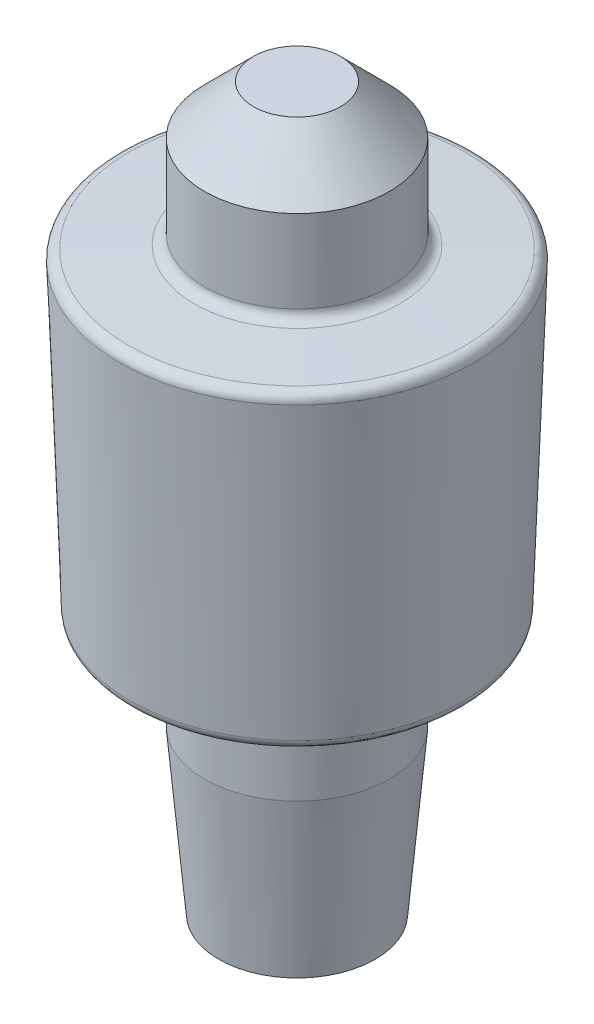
ISO-10303-21;
HEADER;
FILE_DESCRIPTION(('STEP AP214'),'2;1');
FILE_NAME('part.step','',(''),(''),'','','');
FILE_SCHEMA(('AUTOMOTIVE_DESIGN { 1 0 10303 214 1 1 1 1 }'));
ENDSEC;
DATA;
#1=APPLICATION_CONTEXT('core data for automotive mechanical design processes');
#2=APPLICATION_PROTOCOL_DEFINITION('international standard','automotive_design',2000,#1);
#3=PRODUCT_CONTEXT('',#1,'mechanical');
#4=PRODUCT('Part','Part','',(#3));
#5=PRODUCT_RELATED_PRODUCT_CATEGORY('part','',(#4));
#6=PRODUCT_DEFINITION_FORMATION('','',#4);
#7=PRODUCT_DEFINITION_CONTEXT('part definition',#1,'design');
#8=PRODUCT_DEFINITION('design','',#6,#7);
#9=PRODUCT_DEFINITION_SHAPE('','',#8);
#10=(LENGTH_UNIT() NAMED_UNIT(*) SI_UNIT(.MILLI.,.METRE.));
#11=(NAMED_UNIT(*) PLANE_ANGLE_UNIT() SI_UNIT($,.RADIAN.));
#12=(NAMED_UNIT(*) SI_UNIT($,.STERADIAN.) SOLID_ANGLE_UNIT());
#13=UNCERTAINTY_MEASURE_WITH_UNIT(LENGTH_MEASURE(1.E-05),#10,'distance_accuracy_value','');
#14=(GEOMETRIC_REPRESENTATION_CONTEXT(3) GLOBAL_UNCERTAINTY_ASSIGNED_CONTEXT((#13)) GLOBAL_UNIT_ASSIGNED_CONTEXT((#10,
#11,#12)) REPRESENTATION_CONTEXT('',''));
#15=CARTESIAN_POINT('',(0.,0.,0.));
#16=DIRECTION('',(0.,0.,1.));
#17=DIRECTION('',(1.,0.,0.));
#18=AXIS2_PLACEMENT_3D('',#15,#16,#17);
#19=CARTESIAN_POINT('',(-13.7594101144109,-64.5958129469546,-9.03571118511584E-12));
#20=DIRECTION('',(0.,1.,0.));
#21=DIRECTION('',(-0.964273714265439,0.,-0.264907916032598));
#22=AXIS2_PLACEMENT_3D('',#19,#20,#21);
#23=CONICAL_SURFACE('',#22,50.6843004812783,0.0349065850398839);
#24=CARTESIAN_POINT('',(-13.7594101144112,-53.6219287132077,-9.14055835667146E-12));
#25=DIRECTION('',(0.,1.,0.));
#26=DIRECTION('',(-1.,0.,0.));
#27=AXIS2_PLACEMENT_3D('',#24,#25,#26);
#28=CIRCLE('',#27,51.067516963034);
#29=CARTESIAN_POINT('',(-64.8269270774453,-53.6219287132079,-9.14055835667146E-12));
#30=VERTEX_POINT('',#29);
#31=EDGE_CURVE('E10',#30,#30,#28,.T.);
#32=ORIENTED_EDGE('',*,*,#31,.T.);
#33=EDGE_LOOP('',(#32));
#34=FACE_BOUND('',#33,.T.);
#35=CARTESIAN_POINT('',(-13.7594101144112,37.6434261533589,-9.22483774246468E-12));
#36=DIRECTION('',(0.,-1.,0.));
#37=DIRECTION('',(1.,0.,0.));
#38=AXIS2_PLACEMENT_3D('',#35,#36,#37);
#39=CIRCLE('',#38,54.2545733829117);
#40=CARTESIAN_POINT('',(40.4951632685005,37.6434261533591,-9.22483774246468E-12));
#41=VERTEX_POINT('',#40);
#42=EDGE_CURVE('E46',#41,#41,#39,.T.);
#43=ORIENTED_EDGE('',*,*,#42,.T.);
#44=EDGE_LOOP('',(#43));
#45=FACE_BOUND('',#44,.T.);
#46=ADVANCED_FACE('F31',(#34,#45),#23,.T.);
#47=CARTESIAN_POINT('',(-13.7594101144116,40.337284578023,-9.37593259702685E-12));
#48=DIRECTION('',(0.,-1.,0.));
#49=DIRECTION('',(1.,0.,0.));
#50=AXIS2_PLACEMENT_3D('',#47,#48,#49);
#51=CONICAL_SURFACE('',#50,59.1742541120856,1.51843644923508);
#52=CARTESIAN_POINT('',(-13.7594101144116,40.7440132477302,-9.37593259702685E-12));
#53=DIRECTION('',(0.,1.,0.));
#54=DIRECTION('',(-1.,0.,0.));
#55=AXIS2_PLACEMENT_3D('',#52,#53,#54);
#56=CIRCLE('',#55,51.4134087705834);
#57=CARTESIAN_POINT('',(-65.172818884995,40.7440132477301,-9.37593259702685E-12));
#58=VERTEX_POINT('',#57);
#59=EDGE_CURVE('E42',#58,#58,#56,.T.);
#60=ORIENTED_EDGE('',*,*,#59,.T.);
#61=EDGE_LOOP('',(#60));
#62=FACE_BOUND('',#61,.T.);
#63=CARTESIAN_POINT('',(-13.7594101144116,41.7941021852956,-9.37593259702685E-12));
#64=DIRECTION('',(0.,-1.,0.));
#65=DIRECTION('',(1.,0.,0.));
#66=AXIS2_PLACEMENT_3D('',#63,#64,#65);
#67=CIRCLE('',#66,31.3765182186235);
#68=CARTESIAN_POINT('',(17.6171081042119,41.7941021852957,-9.37593259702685E-12));
#69=VERTEX_POINT('',#68);
#70=EDGE_CURVE('E71',#69,#69,#67,.T.);
#71=ORIENTED_EDGE('',*,*,#70,.T.);
#72=EDGE_LOOP('',(#71));
#73=FACE_BOUND('',#72,.T.);
#74=ADVANCED_FACE('F105',(#62,#73),#51,.T.);
#75=CARTESIAN_POINT('',(-13.7594101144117,85.1341831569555,-9.37593259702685E-12));
#76=DIRECTION('',(0.,1.,0.));
#77=DIRECTION('',(-1.,0.,0.));
#78=AXIS2_PLACEMENT_3D('',#75,#76,#77);
#79=PLANE('',#78);
#80=CARTESIAN_POINT('',(-13.7594101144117,85.1341831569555,-9.37593259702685E-12));
#81=DIRECTION('',(0.,1.,0.));
#82=DIRECTION('',(-1.,0.,0.));
#83=AXIS2_PLACEMENT_3D('',#80,#81,#82);
#84=CIRCLE('',#83,13.3400809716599);
#85=CARTESIAN_POINT('',(-27.0994910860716,85.1341831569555,-9.37593259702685E-12));
#86=VERTEX_POINT('',#85);
#87=EDGE_CURVE('E56',#86,#86,#84,.T.);
#88=ORIENTED_EDGE('',*,*,#87,.T.);
#89=EDGE_LOOP('',(#88));
#90=FACE_BOUND('',#89,.T.);
#91=ADVANCED_FACE('F110',(#90),#79,.T.);
#92=CARTESIAN_POINT('',(-13.7594101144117,70.1341831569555,-9.37593259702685E-12));
#93=DIRECTION('',(0.,-1.,0.));
#94=DIRECTION('',(-1.,0.,0.));
#95=AXIS2_PLACEMENT_3D('',#92,#93,#94);
#96=CONICAL_SURFACE('',#95,28.3400809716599,0.785398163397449);
#97=ORIENTED_EDGE('',*,*,#87,.F.);
#98=EDGE_LOOP('',(#97));
#99=FACE_BOUND('',#98,.T.);
#100=CARTESIAN_POINT('',(-13.7594101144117,70.1341831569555,-9.37593259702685E-12));
#101=DIRECTION('',(0.,1.,0.));
#102=DIRECTION('',(-0.964273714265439,0.,-0.264907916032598));
#103=AXIS2_PLACEMENT_3D('',#100,#101,#102);
#104=CIRCLE('',#103,28.3400809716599);
#105=CARTESIAN_POINT('',(-41.0870052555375,70.1341831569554,-7.5075117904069));
#106=VERTEX_POINT('',#105);
#107=EDGE_CURVE('E55',#106,#106,#104,.T.);
#108=ORIENTED_EDGE('',*,*,#107,.T.);
#109=EDGE_LOOP('',(#108));
#110=FACE_BOUND('',#109,.T.);
#111=ADVANCED_FACE('F136',(#99,#110),#96,.T.);
#112=CARTESIAN_POINT('',(-13.7594101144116,41.7941021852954,-9.32350789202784E-12));
#113=DIRECTION('',(0.,1.,0.));
#114=DIRECTION('',(-0.964273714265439,0.,-0.264907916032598));
#115=AXIS2_PLACEMENT_3D('',#112,#113,#114);
#116=CYLINDRICAL_SURFACE('',#115,28.3400809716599);
#117=CARTESIAN_POINT('',(-13.7594101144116,44.8305394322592,-9.32912482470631E-12));
#118=DIRECTION('',(0.,1.,0.));
#119=DIRECTION('',(-0.964273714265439,0.,-0.264907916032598));
#120=AXIS2_PLACEMENT_3D('',#117,#118,#119);
#121=CIRCLE('',#120,28.3400809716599);
#122=CARTESIAN_POINT('',(-41.0870052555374,44.8305394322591,-7.50751179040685));
#123=VERTEX_POINT('',#122);
#124=EDGE_CURVE('E51',#123,#123,#121,.F.);
#125=CARTESIAN_POINT('',(-41.0870052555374,44.8305394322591,-7.50751179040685));
#126=CARTESIAN_POINT('',(-41.0870052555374,45.0941190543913,-7.50751179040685));
#127=CARTESIAN_POINT('',(-41.0870052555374,45.3576986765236,-7.50751179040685));
#128=CARTESIAN_POINT('',(-41.0870052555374,45.8848579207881,-7.50751179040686));
#129=CARTESIAN_POINT('',(-41.0870052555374,46.1484375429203,-7.50751179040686));
#130=CARTESIAN_POINT('',(-41.0870052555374,46.6755967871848,-7.50751179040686));
#131=CARTESIAN_POINT('',(-41.0870052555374,46.9391764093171,-7.50751179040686));
#132=CARTESIAN_POINT('',(-41.0870052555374,47.4663356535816,-7.50751179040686));
#133=CARTESIAN_POINT('',(-41.0870052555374,47.7299152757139,-7.50751179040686));
#134=CARTESIAN_POINT('',(-41.0870052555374,48.2570745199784,-7.50751179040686));
#135=CARTESIAN_POINT('',(-41.0870052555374,48.5206541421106,-7.50751179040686));
#136=CARTESIAN_POINT('',(-41.0870052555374,49.0478133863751,-7.50751179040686));
#137=CARTESIAN_POINT('',(-41.0870052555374,49.3113930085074,-7.50751179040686));
#138=CARTESIAN_POINT('',(-41.0870052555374,49.8385522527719,-7.50751179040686));
#139=CARTESIAN_POINT('',(-41.0870052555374,50.1021318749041,-7.50751179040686));
#140=CARTESIAN_POINT('',(-41.0870052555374,50.6292911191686,-7.50751179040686));
#141=CARTESIAN_POINT('',(-41.0870052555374,50.8928707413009,-7.50751179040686));
#142=CARTESIAN_POINT('',(-41.0870052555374,51.4200299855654,-7.50751179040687));
#143=CARTESIAN_POINT('',(-41.0870052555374,51.6836096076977,-7.50751179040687));
#144=CARTESIAN_POINT('',(-41.0870052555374,52.2107688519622,-7.50751179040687));
#145=CARTESIAN_POINT('',(-41.0870052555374,52.4743484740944,-7.50751179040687));
#146=CARTESIAN_POINT('',(-41.0870052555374,53.0015077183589,-7.50751179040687));
#147=CARTESIAN_POINT('',(-41.0870052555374,53.2650873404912,-7.50751179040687));
#148=CARTESIAN_POINT('',(-41.0870052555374,53.7922465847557,-7.50751179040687));
#149=CARTESIAN_POINT('',(-41.0870052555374,54.0558262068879,-7.50751179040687));
#150=CARTESIAN_POINT('',(-41.0870052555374,54.5829854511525,-7.50751179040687));
#151=CARTESIAN_POINT('',(-41.0870052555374,54.8465650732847,-7.50751179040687));
#152=CARTESIAN_POINT('',(-41.0870052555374,55.3737243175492,-7.50751179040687));
#153=CARTESIAN_POINT('',(-41.0870052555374,55.6373039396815,-7.50751179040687));
#154=CARTESIAN_POINT('',(-41.0870052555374,56.164463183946,-7.50751179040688));
#155=CARTESIAN_POINT('',(-41.0870052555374,56.4280428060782,-7.50751179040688));
#156=CARTESIAN_POINT('',(-41.0870052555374,56.9552020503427,-7.50751179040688));
#157=CARTESIAN_POINT('',(-41.0870052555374,57.218781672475,-7.50751179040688));
#158=CARTESIAN_POINT('',(-41.0870052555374,57.7459409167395,-7.50751179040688));
#159=CARTESIAN_POINT('',(-41.0870052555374,58.0095205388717,-7.50751179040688));
#160=CARTESIAN_POINT('',(-41.0870052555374,58.5366797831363,-7.50751179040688));
#161=CARTESIAN_POINT('',(-41.0870052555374,58.8002594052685,-7.50751179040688));
#162=CARTESIAN_POINT('',(-41.0870052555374,59.327418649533,-7.50751179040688));
#163=CARTESIAN_POINT('',(-41.0870052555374,59.5909982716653,-7.50751179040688));
#164=CARTESIAN_POINT('',(-41.0870052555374,60.1181575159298,-7.50751179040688));
#165=CARTESIAN_POINT('',(-41.0870052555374,60.381737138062,-7.50751179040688));
#166=CARTESIAN_POINT('',(-41.0870052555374,60.9088963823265,-7.50751179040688));
#167=CARTESIAN_POINT('',(-41.0870052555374,61.1724760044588,-7.50751179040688));
#168=CARTESIAN_POINT('',(-41.0870052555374,61.6996352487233,-7.50751179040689));
#169=CARTESIAN_POINT('',(-41.0870052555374,61.9632148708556,-7.50751179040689));
#170=CARTESIAN_POINT('',(-41.0870052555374,62.4903741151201,-7.50751179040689));
#171=CARTESIAN_POINT('',(-41.0870052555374,62.7539537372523,-7.50751179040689));
#172=CARTESIAN_POINT('',(-41.0870052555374,63.2811129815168,-7.50751179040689));
#173=CARTESIAN_POINT('',(-41.0870052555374,63.5446926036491,-7.50751179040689));
#174=CARTESIAN_POINT('',(-41.0870052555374,64.0718518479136,-7.50751179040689));
#175=CARTESIAN_POINT('',(-41.0870052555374,64.3354314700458,-7.50751179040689));
#176=CARTESIAN_POINT('',(-41.0870052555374,64.8625907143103,-7.50751179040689));
#177=CARTESIAN_POINT('',(-41.0870052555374,65.1261703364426,-7.50751179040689));
#178=CARTESIAN_POINT('',(-41.0870052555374,65.6533295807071,-7.50751179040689));
#179=CARTESIAN_POINT('',(-41.0870052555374,65.9169092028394,-7.50751179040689));
#180=CARTESIAN_POINT('',(-41.0870052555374,66.4440684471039,-7.50751179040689));
#181=CARTESIAN_POINT('',(-41.0870052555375,66.7076480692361,-7.50751179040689));
#182=CARTESIAN_POINT('',(-41.0870052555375,67.2348073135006,-7.50751179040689));
#183=CARTESIAN_POINT('',(-41.0870052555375,67.4983869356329,-7.5075117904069));
#184=CARTESIAN_POINT('',(-41.0870052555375,68.0255461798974,-7.5075117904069));
#185=CARTESIAN_POINT('',(-41.0870052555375,68.2891258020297,-7.5075117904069));
#186=CARTESIAN_POINT('',(-41.0870052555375,68.8162850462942,-7.5075117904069));
#187=CARTESIAN_POINT('',(-41.0870052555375,69.0798646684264,-7.5075117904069));
#188=CARTESIAN_POINT('',(-41.0870052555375,69.6070239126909,-7.5075117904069));
#189=CARTESIAN_POINT('',(-41.0870052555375,69.8706035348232,-7.5075117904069));
#190=CARTESIAN_POINT('',(-41.0870052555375,70.1341831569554,-7.5075117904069));
#191=B_SPLINE_CURVE_WITH_KNOTS('',3,(#125,#126,#127,#128,#129,#130,#131,#132,#133,#134,#135,
#136,#137,#138,#139,#140,#141,#142,#143,#144,#145,#146,#147,#148,#149,#150,#151,#152,#153,#154,
#155,#156,#157,#158,#159,#160,#161,#162,#163,#164,#165,#166,#167,#168,#169,#170,#171,#172,#173,
#174,#175,#176,#177,#178,#179,#180,#181,#182,#183,#184,#185,#186,#187,#188,#189,#190),
.UNSPECIFIED.,.F.,.F.,(4,2,2,2,2,2,2,2,2,2,2,2,2,2,2,2,2,2,2,2,2,2,2,2,2,2,2,2,2,2,2,2,4),(0.,
0.790738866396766,1.58147773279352,2.37221659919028,3.16295546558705,3.95369433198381,
4.74443319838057,5.53517206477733,6.32591093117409,7.11664979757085,7.90738866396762,
8.69812753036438,9.48886639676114,10.2796052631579,11.0703441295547,11.8610829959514,
12.6518218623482,13.4425607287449,14.2332995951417,15.0240384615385,15.8147773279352,
16.605516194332,17.3962550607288,18.1869939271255,18.9777327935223,19.768471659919,
20.5592105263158,21.3499493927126,22.1406882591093,22.9314271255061,23.7221659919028,
24.5129048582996,25.3036437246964),.UNSPECIFIED.);
#192=EDGE_CURVE('BSEAM115',#123,#106,#191,.T.);
#193=ORIENTED_EDGE('',*,*,#124,.F.);
#194=ORIENTED_EDGE('',*,*,#107,.F.);
#195=ORIENTED_EDGE('',*,*,#192,.T.);
#196=ORIENTED_EDGE('',*,*,#192,.F.);
#197=EDGE_LOOP('',(#193,#195,#194,#196));
#198=FACE_BOUND('',#197,.T.);
#199=ADVANCED_FACE('F115',(#198),#116,.T.);
#200=CARTESIAN_POINT('',(-13.7594101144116,44.8305394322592,-9.32912482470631E-12));
#201=DIRECTION('',(0.,1.,0.));
#202=DIRECTION('',(-0.964273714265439,0.,-0.264907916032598));
#203=AXIS2_PLACEMENT_3D('',#200,#201,#202);
#204=TOROIDAL_SURFACE('',#203,31.3765182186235,3.03643724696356);
#205=ORIENTED_EDGE('',*,*,#124,.T.);
#206=EDGE_LOOP('',(#205));
#207=FACE_BOUND('',#206,.T.);
#208=ORIENTED_EDGE('',*,*,#70,.F.);
#209=EDGE_LOOP('',(#208));
#210=FACE_BOUND('',#209,.T.);
#211=ADVANCED_FACE('F119',(#207,#210),#204,.F.);
#212=CARTESIAN_POINT('',(-13.7594101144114,37.7481246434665,-9.25195456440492E-12));
#213=DIRECTION('',(0.,1.,0.));
#214=DIRECTION('',(-1.,0.,0.));
#215=AXIS2_PLACEMENT_3D('',#212,#213,#214);
#216=TOROIDAL_SURFACE('',#215,51.2564009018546,3.);
#217=ORIENTED_EDGE('',*,*,#59,.F.);
#218=EDGE_LOOP('',(#217));
#219=FACE_BOUND('',#218,.T.);
#220=ORIENTED_EDGE('',*,*,#42,.F.);
#221=EDGE_LOOP('',(#220));
#222=FACE_BOUND('',#221,.T.);
#223=ADVANCED_FACE('F117',(#219,#222),#216,.T.);
#224=CARTESIAN_POINT('',(-13.7594101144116,-57.3961812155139,-9.23176465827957E-12));
#225=DIRECTION('',(0.,1.,0.));
#226=DIRECTION('',(-1.,0.,0.));
#227=AXIS2_PLACEMENT_3D('',#224,#225,#226);
#228=CONICAL_SURFACE('',#227,31.3765182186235,1.51843644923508);
#229=CARTESIAN_POINT('',(-13.7594101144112,-56.5131188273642,-9.13788423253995E-12));
#230=DIRECTION('',(0.,1.,0.));
#231=DIRECTION('',(-1.,0.,0.));
#232=AXIS2_PLACEMENT_3D('',#229,#230,#231);
#233=CIRCLE('',#232,48.2263523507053);
#234=CARTESIAN_POINT('',(-61.9857624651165,-56.513118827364,-9.13788423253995E-12));
#235=VERTEX_POINT('',#234);
#236=EDGE_CURVE('E38',#235,#235,#233,.F.);
#237=ORIENTED_EDGE('',*,*,#236,.T.);
#238=EDGE_LOOP('',(#237));
#239=FACE_BOUND('',#238,.T.);
#240=CARTESIAN_POINT('',(-13.7594101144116,-57.3961812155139,-9.23176465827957E-12));
#241=DIRECTION('',(0.,1.,0.));
#242=DIRECTION('',(-1.,0.,0.));
#243=AXIS2_PLACEMENT_3D('',#240,#241,#242);
#244=CIRCLE('',#243,31.3765182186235);
#245=CARTESIAN_POINT('',(-45.1359283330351,-57.3961812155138,-9.23176465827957E-12));
#246=VERTEX_POINT('',#245);
#247=EDGE_CURVE('E74',#246,#246,#244,.T.);
#248=ORIENTED_EDGE('',*,*,#247,.T.);
#249=EDGE_LOOP('',(#248));
#250=FACE_BOUND('',#249,.T.);
#251=ADVANCED_FACE('F78',(#239,#250),#228,.T.);
#252=CARTESIAN_POINT('',(-13.7594101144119,-135.736262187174,-9.23176465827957E-12));
#253=DIRECTION('',(0.,-1.,0.));
#254=DIRECTION('',(1.,0.,0.));
#255=AXIS2_PLACEMENT_3D('',#252,#253,#254);
#256=PLANE('',#255);
#257=CARTESIAN_POINT('',(-13.7594101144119,-135.736262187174,-9.23176465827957E-12));
#258=DIRECTION('',(0.,-1.,0.));
#259=DIRECTION('',(1.,0.,0.));
#260=AXIS2_PLACEMENT_3D('',#257,#258,#259);
#261=CIRCLE('',#260,23.9656477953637);
#262=CARTESIAN_POINT('',(10.2062376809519,-135.736262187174,-9.23176465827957E-12));
#263=VERTEX_POINT('',#262);
#264=EDGE_CURVE('E64',#263,#263,#261,.T.);
#265=ORIENTED_EDGE('',*,*,#264,.T.);
#266=EDGE_LOOP('',(#265));
#267=FACE_BOUND('',#266,.T.);
#268=ADVANCED_FACE('F94',(#267),#256,.T.);
#269=CARTESIAN_POINT('',(-13.7594101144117,-85.7362621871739,-9.23176465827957E-12));
#270=DIRECTION('',(0.,1.,0.));
#271=DIRECTION('',(1.,0.,0.));
#272=AXIS2_PLACEMENT_3D('',#269,#270,#271);
#273=CONICAL_SURFACE('',#272,28.3400809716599,0.0872664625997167);
#274=ORIENTED_EDGE('',*,*,#264,.F.);
#275=EDGE_LOOP('',(#274));
#276=FACE_BOUND('',#275,.T.);
#277=CARTESIAN_POINT('',(-13.7594101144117,-85.7362621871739,-9.23176465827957E-12));
#278=DIRECTION('',(0.,-1.,0.));
#279=DIRECTION('',(1.,0.,0.));
#280=AXIS2_PLACEMENT_3D('',#277,#278,#279);
#281=CIRCLE('',#280,28.3400809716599);
#282=CARTESIAN_POINT('',(-41.0870052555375,-85.7362621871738,-7.50751179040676));
#283=VERTEX_POINT('',#282);
#284=EDGE_CURVE('E67',#283,#283,#281,.T.);
#285=ORIENTED_EDGE('',*,*,#284,.T.);
#286=EDGE_LOOP('',(#285));
#287=FACE_BOUND('',#286,.T.);
#288=ADVANCED_FACE('F89',(#276,#287),#273,.T.);
#289=CARTESIAN_POINT('',(-13.7594101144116,-57.3961812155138,-9.23176465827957E-12));
#290=DIRECTION('',(0.,-1.,0.));
#291=DIRECTION('',(-0.964273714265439,0.,-0.264907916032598));
#292=AXIS2_PLACEMENT_3D('',#289,#290,#291);
#293=CYLINDRICAL_SURFACE('',#292,28.3400809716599);
#294=CARTESIAN_POINT('',(-13.7594101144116,-60.4326184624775,-9.23176465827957E-12));
#295=DIRECTION('',(0.,-1.,0.));
#296=DIRECTION('',(0.964273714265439,0.,0.264907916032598));
#297=AXIS2_PLACEMENT_3D('',#294,#295,#296);
#298=CIRCLE('',#297,28.3400809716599);
#299=CARTESIAN_POINT('',(-41.0870052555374,-60.4326184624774,-7.50751179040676));
#300=VERTEX_POINT('',#299);
#301=EDGE_CURVE('E52',#300,#300,#298,.F.);
#302=CARTESIAN_POINT('',(-41.0870052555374,-60.4326184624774,-7.50751179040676));
#303=CARTESIAN_POINT('',(-41.0870052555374,-60.6961980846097,-7.50751179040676));
#304=CARTESIAN_POINT('',(-41.0870052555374,-60.9597777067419,-7.50751179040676));
#305=CARTESIAN_POINT('',(-41.0870052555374,-61.4869369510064,-7.50751179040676));
#306=CARTESIAN_POINT('',(-41.0870052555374,-61.7505165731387,-7.50751179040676));
#307=CARTESIAN_POINT('',(-41.0870052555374,-62.2776758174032,-7.50751179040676));
#308=CARTESIAN_POINT('',(-41.0870052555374,-62.5412554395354,-7.50751179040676));
#309=CARTESIAN_POINT('',(-41.0870052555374,-63.0684146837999,-7.50751179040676));
#310=CARTESIAN_POINT('',(-41.0870052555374,-63.3319943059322,-7.50751179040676));
#311=CARTESIAN_POINT('',(-41.0870052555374,-63.8591535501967,-7.50751179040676));
#312=CARTESIAN_POINT('',(-41.0870052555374,-64.122733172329,-7.50751179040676));
#313=CARTESIAN_POINT('',(-41.0870052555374,-64.6498924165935,-7.50751179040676));
#314=CARTESIAN_POINT('',(-41.0870052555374,-64.9134720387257,-7.50751179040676));
#315=CARTESIAN_POINT('',(-41.0870052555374,-65.4406312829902,-7.50751179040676));
#316=CARTESIAN_POINT('',(-41.0870052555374,-65.7042109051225,-7.50751179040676));
#317=CARTESIAN_POINT('',(-41.0870052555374,-66.231370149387,-7.50751179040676));
#318=CARTESIAN_POINT('',(-41.0870052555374,-66.4949497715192,-7.50751179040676));
#319=CARTESIAN_POINT('',(-41.0870052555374,-67.0221090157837,-7.50751179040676));
#320=CARTESIAN_POINT('',(-41.0870052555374,-67.285688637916,-7.50751179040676));
#321=CARTESIAN_POINT('',(-41.0870052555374,-67.8128478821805,-7.50751179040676));
#322=CARTESIAN_POINT('',(-41.0870052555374,-68.0764275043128,-7.50751179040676));
#323=CARTESIAN_POINT('',(-41.0870052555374,-68.6035867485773,-7.50751179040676));
#324=CARTESIAN_POINT('',(-41.0870052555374,-68.8671663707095,-7.50751179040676));
#325=CARTESIAN_POINT('',(-41.0870052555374,-69.394325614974,-7.50751179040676));
#326=CARTESIAN_POINT('',(-41.0870052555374,-69.6579052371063,-7.50751179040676));
#327=CARTESIAN_POINT('',(-41.0870052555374,-70.1850644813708,-7.50751179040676));
#328=CARTESIAN_POINT('',(-41.0870052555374,-70.4486441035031,-7.50751179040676));
#329=CARTESIAN_POINT('',(-41.0870052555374,-70.9758033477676,-7.50751179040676));
#330=CARTESIAN_POINT('',(-41.0870052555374,-71.2393829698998,-7.50751179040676));
#331=CARTESIAN_POINT('',(-41.0870052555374,-71.7665422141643,-7.50751179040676));
#332=CARTESIAN_POINT('',(-41.0870052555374,-72.0301218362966,-7.50751179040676));
#333=CARTESIAN_POINT('',(-41.0870052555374,-72.5572810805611,-7.50751179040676));
#334=CARTESIAN_POINT('',(-41.0870052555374,-72.8208607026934,-7.50751179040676));
#335=CARTESIAN_POINT('',(-41.0870052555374,-73.3480199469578,-7.50751179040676));
#336=CARTESIAN_POINT('',(-41.0870052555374,-73.6115995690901,-7.50751179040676));
#337=CARTESIAN_POINT('',(-41.0870052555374,-74.1387588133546,-7.50751179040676));
#338=CARTESIAN_POINT('',(-41.0870052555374,-74.4023384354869,-7.50751179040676));
#339=CARTESIAN_POINT('',(-41.0870052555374,-74.9294976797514,-7.50751179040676));
#340=CARTESIAN_POINT('',(-41.0870052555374,-75.1930773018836,-7.50751179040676));
#341=CARTESIAN_POINT('',(-41.0870052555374,-75.7202365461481,-7.50751179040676));
#342=CARTESIAN_POINT('',(-41.0870052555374,-75.9838161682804,-7.50751179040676));
#343=CARTESIAN_POINT('',(-41.0870052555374,-76.5109754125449,-7.50751179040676));
#344=CARTESIAN_POINT('',(-41.0870052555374,-76.7745550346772,-7.50751179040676));
#345=CARTESIAN_POINT('',(-41.0870052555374,-77.3017142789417,-7.50751179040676));
#346=CARTESIAN_POINT('',(-41.0870052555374,-77.5652939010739,-7.50751179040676));
#347=CARTESIAN_POINT('',(-41.0870052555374,-78.0924531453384,-7.50751179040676));
#348=CARTESIAN_POINT('',(-41.0870052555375,-78.3560327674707,-7.50751179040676));
#349=CARTESIAN_POINT('',(-41.0870052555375,-78.8831920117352,-7.50751179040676));
#350=CARTESIAN_POINT('',(-41.0870052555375,-79.1467716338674,-7.50751179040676));
#351=CARTESIAN_POINT('',(-41.0870052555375,-79.6739308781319,-7.50751179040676));
#352=CARTESIAN_POINT('',(-41.0870052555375,-79.9375105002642,-7.50751179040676));
#353=CARTESIAN_POINT('',(-41.0870052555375,-80.4646697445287,-7.50751179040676));
#354=CARTESIAN_POINT('',(-41.0870052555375,-80.728249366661,-7.50751179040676));
#355=CARTESIAN_POINT('',(-41.0870052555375,-81.2554086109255,-7.50751179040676));
#356=CARTESIAN_POINT('',(-41.0870052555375,-81.5189882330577,-7.50751179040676));
#357=CARTESIAN_POINT('',(-41.0870052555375,-82.0461474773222,-7.50751179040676));
#358=CARTESIAN_POINT('',(-41.0870052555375,-82.3097270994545,-7.50751179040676));
#359=CARTESIAN_POINT('',(-41.0870052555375,-82.836886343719,-7.50751179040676));
#360=CARTESIAN_POINT('',(-41.0870052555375,-83.1004659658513,-7.50751179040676));
#361=CARTESIAN_POINT('',(-41.0870052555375,-83.6276252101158,-7.50751179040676));
#362=CARTESIAN_POINT('',(-41.0870052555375,-83.891204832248,-7.50751179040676));
#363=CARTESIAN_POINT('',(-41.0870052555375,-84.4183640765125,-7.50751179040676));
#364=CARTESIAN_POINT('',(-41.0870052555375,-84.6819436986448,-7.50751179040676));
#365=CARTESIAN_POINT('',(-41.0870052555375,-85.2091029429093,-7.50751179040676));
#366=CARTESIAN_POINT('',(-41.0870052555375,-85.4726825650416,-7.50751179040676));
#367=CARTESIAN_POINT('',(-41.0870052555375,-85.7362621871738,-7.50751179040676));
#368=B_SPLINE_CURVE_WITH_KNOTS('',3,(#302,#303,#304,#305,#306,#307,#308,#309,#310,#311,#312,
#313,#314,#315,#316,#317,#318,#319,#320,#321,#322,#323,#324,#325,#326,#327,#328,#329,#330,#331,
#332,#333,#334,#335,#336,#337,#338,#339,#340,#341,#342,#343,#344,#345,#346,#347,#348,#349,#350,
#351,#352,#353,#354,#355,#356,#357,#358,#359,#360,#361,#362,#363,#364,#365,#366,#367),
.UNSPECIFIED.,.F.,.F.,(4,2,2,2,2,2,2,2,2,2,2,2,2,2,2,2,2,2,2,2,2,2,2,2,2,2,2,2,2,2,2,2,4),(0.,
0.790738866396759,1.58147773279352,2.37221659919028,3.16295546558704,3.9536943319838,
4.74443319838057,5.53517206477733,6.32591093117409,7.11664979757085,7.90738866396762,
8.69812753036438,9.48886639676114,10.2796052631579,11.0703441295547,11.8610829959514,
12.6518218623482,13.442560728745,14.2332995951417,15.0240384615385,15.8147773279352,
16.605516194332,17.3962550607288,18.1869939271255,18.9777327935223,19.7684716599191,
20.5592105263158,21.3499493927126,22.1406882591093,22.9314271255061,23.7221659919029,
24.5129048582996,25.3036437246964),.UNSPECIFIED.);
#369=EDGE_CURVE('BSEAM83',#300,#283,#368,.T.);
#370=ORIENTED_EDGE('',*,*,#301,.F.);
#371=ORIENTED_EDGE('',*,*,#284,.F.);
#372=ORIENTED_EDGE('',*,*,#369,.T.);
#373=ORIENTED_EDGE('',*,*,#369,.F.);
#374=EDGE_LOOP('',(#370,#372,#371,#373));
#375=FACE_BOUND('',#374,.T.);
#376=ADVANCED_FACE('F83',(#375),#293,.T.);
#377=CARTESIAN_POINT('',(-13.7594101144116,-60.4326184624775,-9.23176465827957E-12));
#378=DIRECTION('',(0.,-1.,0.));
#379=DIRECTION('',(0.964273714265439,0.,0.264907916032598));
#380=AXIS2_PLACEMENT_3D('',#377,#378,#379);
#381=TOROIDAL_SURFACE('',#380,31.3765182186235,3.03643724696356);
#382=ORIENTED_EDGE('',*,*,#247,.F.);
#383=EDGE_LOOP('',(#382));
#384=FACE_BOUND('',#383,.T.);
#385=ORIENTED_EDGE('',*,*,#301,.T.);
#386=EDGE_LOOP('',(#385));
#387=FACE_BOUND('',#386,.T.);
#388=ADVANCED_FACE('F80',(#384,#387),#381,.F.);
#389=CARTESIAN_POINT('',(-13.7594101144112,-53.5172302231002,-9.14065519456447E-12));
#390=DIRECTION('',(0.,1.,0.));
#391=DIRECTION('',(0.,0.,1.));
#392=AXIS2_PLACEMENT_3D('',#389,#390,#391);
#393=TOROIDAL_SURFACE('',#392,48.0693444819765,3.);
#394=ORIENTED_EDGE('',*,*,#31,.F.);
#395=EDGE_LOOP('',(#394));
#396=FACE_BOUND('',#395,.T.);
#397=ORIENTED_EDGE('',*,*,#236,.F.);
#398=EDGE_LOOP('',(#397));
#399=FACE_BOUND('',#398,.T.);
#400=ADVANCED_FACE('F33',(#396,#399),#393,.T.);
#401=CLOSED_SHELL('',(#46,#74,#91,#111,#199,#211,#223,#251,#268,#288,#376,#388,#400));
#402=MANIFOLD_SOLID_BREP('B2',#401);
#403=ADVANCED_BREP_SHAPE_REPRESENTATION('',(#18,#402),#14);
#404=SHAPE_DEFINITION_REPRESENTATION(#9,#403);
ENDSEC;
END-ISO-10303-21;
